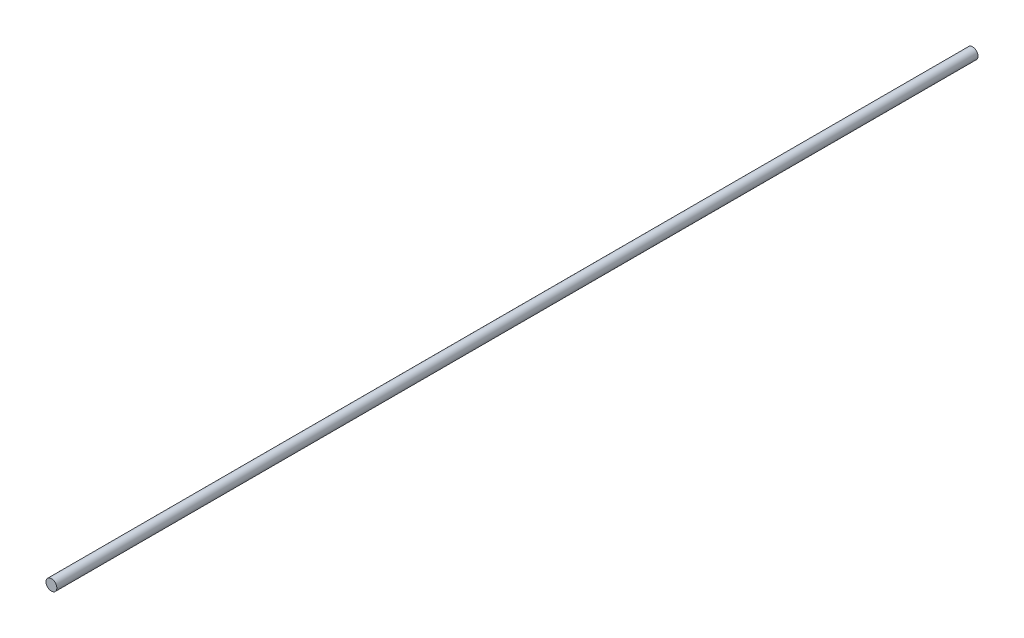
ISO-10303-21;
HEADER;
FILE_DESCRIPTION(('STEP AP214'),'2;1');
FILE_NAME('part.step','',(''),(''),'','','');
FILE_SCHEMA(('AUTOMOTIVE_DESIGN { 1 0 10303 214 1 1 1 1 }'));
ENDSEC;
DATA;
#1=APPLICATION_CONTEXT('core data for automotive mechanical design processes');
#2=APPLICATION_PROTOCOL_DEFINITION('international standard','automotive_design',2000,#1);
#3=PRODUCT_CONTEXT('',#1,'mechanical');
#4=PRODUCT('Part','Part','',(#3));
#5=PRODUCT_RELATED_PRODUCT_CATEGORY('part','',(#4));
#6=PRODUCT_DEFINITION_FORMATION('','',#4);
#7=PRODUCT_DEFINITION_CONTEXT('part definition',#1,'design');
#8=PRODUCT_DEFINITION('design','',#6,#7);
#9=PRODUCT_DEFINITION_SHAPE('','',#8);
#10=(LENGTH_UNIT() NAMED_UNIT(*) SI_UNIT(.MILLI.,.METRE.));
#11=(NAMED_UNIT(*) PLANE_ANGLE_UNIT() SI_UNIT($,.RADIAN.));
#12=(NAMED_UNIT(*) SI_UNIT($,.STERADIAN.) SOLID_ANGLE_UNIT());
#13=UNCERTAINTY_MEASURE_WITH_UNIT(LENGTH_MEASURE(1.E-05),#10,'distance_accuracy_value','');
#14=(GEOMETRIC_REPRESENTATION_CONTEXT(3) GLOBAL_UNCERTAINTY_ASSIGNED_CONTEXT((#13)) GLOBAL_UNIT_ASSIGNED_CONTEXT((#10,
#11,#12)) REPRESENTATION_CONTEXT('',''));
#15=CARTESIAN_POINT('',(0.,0.,0.));
#16=DIRECTION('',(0.,0.,1.));
#17=DIRECTION('',(1.,0.,0.));
#18=AXIS2_PLACEMENT_3D('',#15,#16,#17);
#19=CARTESIAN_POINT('',(0.,0.,-5100.));
#20=DIRECTION('',(0.,0.,1.));
#21=DIRECTION('',(1.,0.,0.));
#22=AXIS2_PLACEMENT_3D('',#19,#20,#21);
#23=CYLINDRICAL_SURFACE('',#22,30.);
#24=CARTESIAN_POINT('',(0.,0.,-5100.));
#25=DIRECTION('',(0.,0.,1.));
#26=DIRECTION('',(1.,0.,0.));
#27=AXIS2_PLACEMENT_3D('',#24,#25,#26);
#28=CIRCLE('',#27,30.);
#29=CARTESIAN_POINT('',(30.,0.,-5100.));
#30=VERTEX_POINT('',#29);
#31=EDGE_CURVE('E10',#30,#30,#28,.T.);
#32=ORIENTED_EDGE('',*,*,#31,.T.);
#33=EDGE_LOOP('',(#32));
#34=FACE_BOUND('',#33,.T.);
#35=CARTESIAN_POINT('',(0.,0.,0.));
#36=DIRECTION('',(0.,0.,1.));
#37=DIRECTION('',(1.,0.,0.));
#38=AXIS2_PLACEMENT_3D('',#35,#36,#37);
#39=CIRCLE('',#38,30.);
#40=CARTESIAN_POINT('',(30.,0.,0.));
#41=VERTEX_POINT('',#40);
#42=EDGE_CURVE('E40',#41,#41,#39,.T.);
#43=ORIENTED_EDGE('',*,*,#42,.F.);
#44=EDGE_LOOP('',(#43));
#45=FACE_BOUND('',#44,.T.);
#46=ADVANCED_FACE('F37',(#34,#45),#23,.T.);
#47=CARTESIAN_POINT('',(0.,0.,-5100.));
#48=DIRECTION('',(0.,0.,1.));
#49=DIRECTION('',(1.,0.,0.));
#50=AXIS2_PLACEMENT_3D('',#47,#48,#49);
#51=PLANE('',#50);
#52=ORIENTED_EDGE('',*,*,#31,.F.);
#53=EDGE_LOOP('',(#52));
#54=FACE_BOUND('',#53,.T.);
#55=ADVANCED_FACE('F54',(#54),#51,.F.);
#56=CARTESIAN_POINT('',(0.,0.,0.));
#57=DIRECTION('',(0.,0.,1.));
#58=DIRECTION('',(1.,0.,0.));
#59=AXIS2_PLACEMENT_3D('',#56,#57,#58);
#60=PLANE('',#59);
#61=ORIENTED_EDGE('',*,*,#42,.T.);
#62=EDGE_LOOP('',(#61));
#63=FACE_BOUND('',#62,.T.);
#64=ADVANCED_FACE('F51',(#63),#60,.T.);
#65=CLOSED_SHELL('',(#46,#55,#64));
#66=MANIFOLD_SOLID_BREP('B2',#65);
#67=ADVANCED_BREP_SHAPE_REPRESENTATION('',(#18,#66),#14);
#68=SHAPE_DEFINITION_REPRESENTATION(#9,#67);
ENDSEC;
END-ISO-10303-21;
